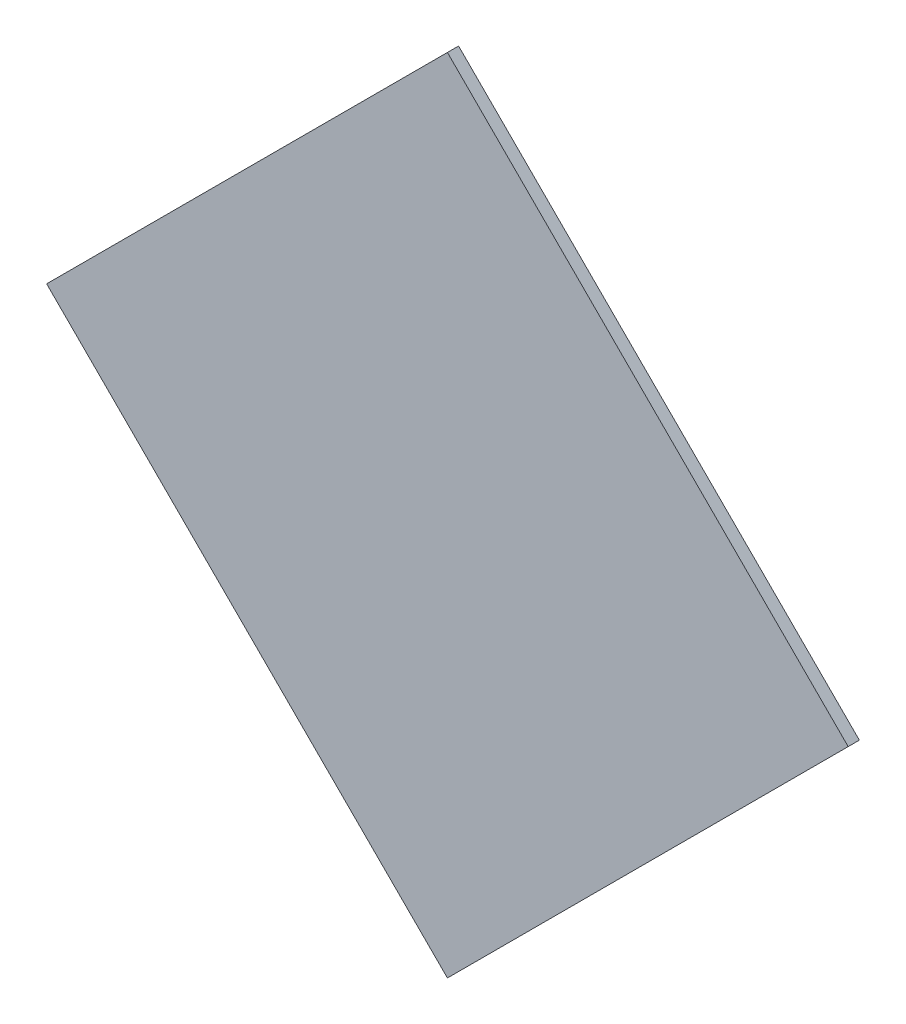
ISO-10303-21;
HEADER;
FILE_DESCRIPTION(('STEP AP214'),'2;1');
FILE_NAME('part.step','',(''),(''),'','','');
FILE_SCHEMA(('AUTOMOTIVE_DESIGN { 1 0 10303 214 1 1 1 1 }'));
ENDSEC;
DATA;
#1=APPLICATION_CONTEXT('core data for automotive mechanical design processes');
#2=APPLICATION_PROTOCOL_DEFINITION('international standard','automotive_design',2000,#1);
#3=PRODUCT_CONTEXT('',#1,'mechanical');
#4=PRODUCT('Part','Part','',(#3));
#5=PRODUCT_RELATED_PRODUCT_CATEGORY('part','',(#4));
#6=PRODUCT_DEFINITION_FORMATION('','',#4);
#7=PRODUCT_DEFINITION_CONTEXT('part definition',#1,'design');
#8=PRODUCT_DEFINITION('design','',#6,#7);
#9=PRODUCT_DEFINITION_SHAPE('','',#8);
#10=(LENGTH_UNIT() NAMED_UNIT(*) SI_UNIT(.MILLI.,.METRE.));
#11=(NAMED_UNIT(*) PLANE_ANGLE_UNIT() SI_UNIT($,.RADIAN.));
#12=(NAMED_UNIT(*) SI_UNIT($,.STERADIAN.) SOLID_ANGLE_UNIT());
#13=UNCERTAINTY_MEASURE_WITH_UNIT(LENGTH_MEASURE(1.E-05),#10,'distance_accuracy_value','');
#14=(GEOMETRIC_REPRESENTATION_CONTEXT(3) GLOBAL_UNCERTAINTY_ASSIGNED_CONTEXT((#13)) GLOBAL_UNIT_ASSIGNED_CONTEXT((#10,
#11,#12)) REPRESENTATION_CONTEXT('',''));
#15=CARTESIAN_POINT('',(0.,0.,0.));
#16=DIRECTION('',(0.,0.,1.));
#17=DIRECTION('',(1.,0.,0.));
#18=AXIS2_PLACEMENT_3D('',#15,#16,#17);
#19=CARTESIAN_POINT('',(0.,-0.35921188,0.));
#20=DIRECTION('',(-0.70711178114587,-0.70710178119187,0.));
#21=DIRECTION('',(-0.70710178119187,0.70711178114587,0.));
#22=AXIS2_PLACEMENT_3D('',#19,#20,#21);
#23=PLANE('',#22);
#24=DIRECTION('',(0.,0.,1.));
#25=VECTOR('',#24,1.);
#26=CARTESIAN_POINT('',(0.,-0.35921188,0.));
#27=LINE('',#26,#25);
#28=CARTESIAN_POINT('',(0.,-0.35921188,0.));
#29=VERTEX_POINT('',#28);
#30=CARTESIAN_POINT('',(0.,-0.35921188,0.00999998));
#31=VERTEX_POINT('',#30);
#32=EDGE_CURVE('E11',#29,#31,#27,.T.);
#33=ORIENTED_EDGE('',*,*,#32,.T.);
#34=DIRECTION('',(-0.70710178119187,0.70711178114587,0.));
#35=VECTOR('',#34,1.);
#36=CARTESIAN_POINT('',(0.,-0.35921188,0.00999998));
#37=LINE('',#36,#35);
#38=CARTESIAN_POINT('',(-0.35920934,2.539999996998E-06,0.00999998));
#39=VERTEX_POINT('',#38);
#40=EDGE_CURVE('E25',#31,#39,#37,.T.);
#41=ORIENTED_EDGE('',*,*,#40,.T.);
#42=DIRECTION('',(0.,0.,1.));
#43=VECTOR('',#42,1.);
#44=CARTESIAN_POINT('',(-0.35920934,2.539999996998E-06,0.));
#45=LINE('',#44,#43);
#46=CARTESIAN_POINT('',(-0.35920934,2.539999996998E-06,0.));
#47=VERTEX_POINT('',#46);
#48=EDGE_CURVE('E73',#47,#39,#45,.T.);
#49=ORIENTED_EDGE('',*,*,#48,.F.);
#50=DIRECTION('',(-0.70710178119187,0.70711178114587,0.));
#51=VECTOR('',#50,1.);
#52=CARTESIAN_POINT('',(0.,-0.35921188,0.));
#53=LINE('',#52,#51);
#54=EDGE_CURVE('E99',#29,#47,#53,.T.);
#55=ORIENTED_EDGE('',*,*,#54,.F.);
#56=EDGE_LOOP('',(#33,#41,#49,#55));
#57=FACE_BOUND('',#56,.T.);
#58=ADVANCED_FACE('F17',(#57),#23,.T.);
#59=CARTESIAN_POINT('',(3.174988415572E-07,6.349960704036E-07,0.));
#60=DIRECTION('',(0.,0.,-1.));
#61=DIRECTION('',(-1.,0.,0.));
#62=AXIS2_PLACEMENT_3D('',#59,#60,#61);
#63=PLANE('',#62);
#64=ORIENTED_EDGE('',*,*,#54,.T.);
#65=DIRECTION('',(0.707109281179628,0.707104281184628,0.));
#66=VECTOR('',#65,1.);
#67=CARTESIAN_POINT('',(-0.35920934,2.539999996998E-06,0.));
#68=LINE('',#67,#66);
#69=CARTESIAN_POINT('',(2.539999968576E-06,0.35921188,0.));
#70=VERTEX_POINT('',#69);
#71=EDGE_CURVE('E95',#47,#70,#68,.T.);
#72=ORIENTED_EDGE('',*,*,#71,.T.);
#73=DIRECTION('',(0.707104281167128,-0.707109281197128,0.));
#74=VECTOR('',#73,1.);
#75=CARTESIAN_POINT('',(2.539999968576E-06,0.35921188,0.));
#76=LINE('',#75,#74);
#77=CARTESIAN_POINT('',(0.35920934,2.539999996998E-06,0.));
#78=VERTEX_POINT('',#77);
#79=EDGE_CURVE('E68',#70,#78,#76,.T.);
#80=ORIENTED_EDGE('',*,*,#79,.T.);
#81=DIRECTION('',(-0.70710178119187,-0.70711178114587,0.));
#82=VECTOR('',#81,1.);
#83=CARTESIAN_POINT('',(0.35920934,2.539999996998E-06,0.));
#84=LINE('',#83,#82);
#85=EDGE_CURVE('E87',#78,#29,#84,.T.);
#86=ORIENTED_EDGE('',*,*,#85,.T.);
#87=EDGE_LOOP('',(#64,#72,#80,#86));
#88=FACE_BOUND('',#87,.T.);
#89=ADVANCED_FACE('F112',(#88),#63,.T.);
#90=CARTESIAN_POINT('',(0.35920934,2.539999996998E-06,0.));
#91=DIRECTION('',(0.70711178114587,-0.70710178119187,0.));
#92=DIRECTION('',(-0.70710178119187,-0.70711178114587,0.));
#93=AXIS2_PLACEMENT_3D('',#90,#91,#92);
#94=PLANE('',#93);
#95=DIRECTION('',(0.,0.,1.));
#96=VECTOR('',#95,1.);
#97=CARTESIAN_POINT('',(0.35920934,2.539999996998E-06,0.));
#98=LINE('',#97,#96);
#99=CARTESIAN_POINT('',(0.35920934,2.539999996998E-06,0.00999998));
#100=VERTEX_POINT('',#99);
#101=EDGE_CURVE('E83',#78,#100,#98,.T.);
#102=ORIENTED_EDGE('',*,*,#101,.T.);
#103=DIRECTION('',(-0.70710178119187,-0.70711178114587,0.));
#104=VECTOR('',#103,1.);
#105=CARTESIAN_POINT('',(0.35920934,2.539999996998E-06,0.00999998));
#106=LINE('',#105,#104);
#107=EDGE_CURVE('E60',#100,#31,#106,.T.);
#108=ORIENTED_EDGE('',*,*,#107,.T.);
#109=ORIENTED_EDGE('',*,*,#32,.F.);
#110=ORIENTED_EDGE('',*,*,#85,.F.);
#111=EDGE_LOOP('',(#102,#108,#109,#110));
#112=FACE_BOUND('',#111,.T.);
#113=ADVANCED_FACE('F119',(#112),#94,.T.);
#114=CARTESIAN_POINT('',(3.174988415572E-07,6.349960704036E-07,0.00999998));
#115=DIRECTION('',(0.,0.,-1.));
#116=DIRECTION('',(-1.,0.,0.));
#117=AXIS2_PLACEMENT_3D('',#114,#115,#116);
#118=PLANE('',#117);
#119=ORIENTED_EDGE('',*,*,#107,.F.);
#120=DIRECTION('',(0.707104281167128,-0.707109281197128,0.));
#121=VECTOR('',#120,1.);
#122=CARTESIAN_POINT('',(2.539999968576E-06,0.35921188,0.00999998));
#123=LINE('',#122,#121);
#124=CARTESIAN_POINT('',(2.539999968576E-06,0.35921188,0.00999998));
#125=VERTEX_POINT('',#124);
#126=EDGE_CURVE('E54',#125,#100,#123,.T.);
#127=ORIENTED_EDGE('',*,*,#126,.F.);
#128=DIRECTION('',(0.707109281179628,0.707104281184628,0.));
#129=VECTOR('',#128,1.);
#130=CARTESIAN_POINT('',(-0.35920934,2.539999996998E-06,0.00999998));
#131=LINE('',#130,#129);
#132=EDGE_CURVE('E58',#39,#125,#131,.T.);
#133=ORIENTED_EDGE('',*,*,#132,.F.);
#134=ORIENTED_EDGE('',*,*,#40,.F.);
#135=EDGE_LOOP('',(#119,#127,#133,#134));
#136=FACE_BOUND('',#135,.T.);
#137=ADVANCED_FACE('F56',(#136),#118,.F.);
#138=CARTESIAN_POINT('',(-0.35920934,2.539999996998E-06,0.));
#139=DIRECTION('',(-0.707104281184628,0.707109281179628,0.));
#140=DIRECTION('',(0.707109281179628,0.707104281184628,0.));
#141=AXIS2_PLACEMENT_3D('',#138,#139,#140);
#142=PLANE('',#141);
#143=ORIENTED_EDGE('',*,*,#48,.T.);
#144=ORIENTED_EDGE('',*,*,#132,.T.);
#145=DIRECTION('',(0.,0.,1.));
#146=VECTOR('',#145,1.);
#147=CARTESIAN_POINT('',(2.539999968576E-06,0.35921188,0.));
#148=LINE('',#147,#146);
#149=EDGE_CURVE('E66',#70,#125,#148,.T.);
#150=ORIENTED_EDGE('',*,*,#149,.F.);
#151=ORIENTED_EDGE('',*,*,#71,.F.);
#152=EDGE_LOOP('',(#143,#144,#150,#151));
#153=FACE_BOUND('',#152,.T.);
#154=ADVANCED_FACE('F72',(#153),#142,.T.);
#155=CARTESIAN_POINT('',(2.539999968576E-06,0.35921188,0.));
#156=DIRECTION('',(0.707109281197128,0.707104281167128,0.));
#157=DIRECTION('',(0.707104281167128,-0.707109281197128,0.));
#158=AXIS2_PLACEMENT_3D('',#155,#156,#157);
#159=PLANE('',#158);
#160=ORIENTED_EDGE('',*,*,#149,.T.);
#161=ORIENTED_EDGE('',*,*,#126,.T.);
#162=ORIENTED_EDGE('',*,*,#101,.F.);
#163=ORIENTED_EDGE('',*,*,#79,.F.);
#164=EDGE_LOOP('',(#160,#161,#162,#163));
#165=FACE_BOUND('',#164,.T.);
#166=ADVANCED_FACE('F67',(#165),#159,.T.);
#167=CLOSED_SHELL('',(#58,#89,#113,#137,#154,#166));
#168=MANIFOLD_SOLID_BREP('B1',#167);
#169=ADVANCED_BREP_SHAPE_REPRESENTATION('',(#18,#168),#14);
#170=SHAPE_DEFINITION_REPRESENTATION(#9,#169);
ENDSEC;
END-ISO-10303-21;
